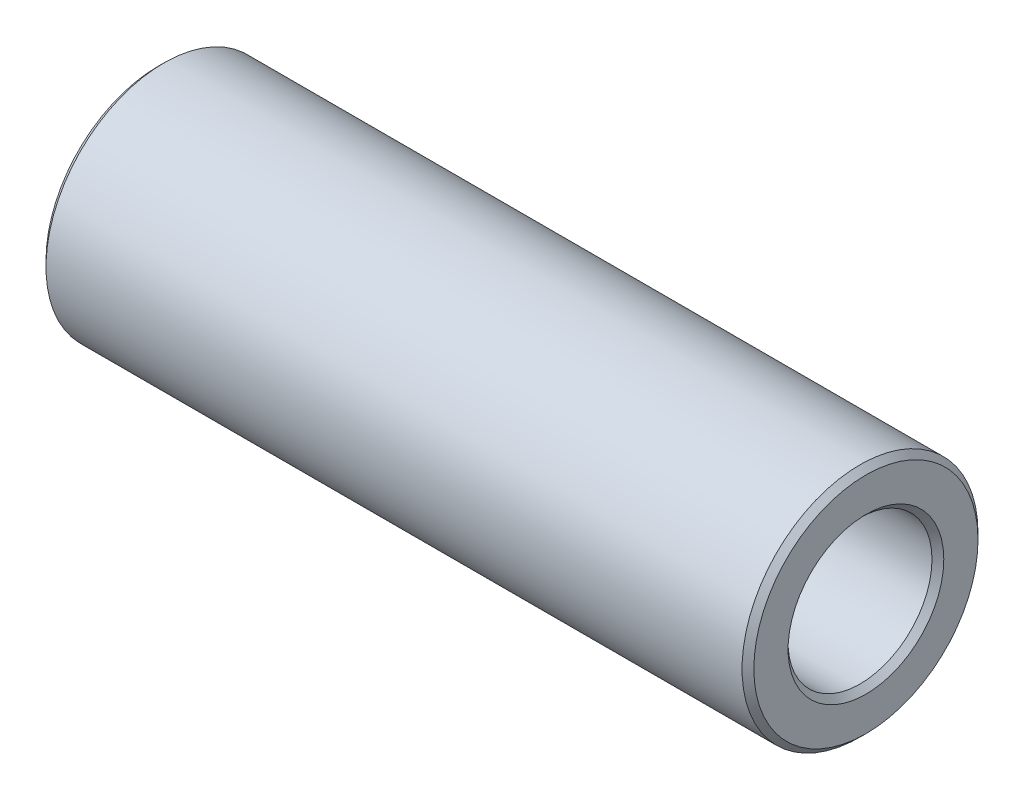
from build123d import *

# Parameters (mm, degrees)
SKETCH_1_R      = 5
SKETCH_1_R_2    = 3.05
EXTRUDE_1_DEPTH = 30
CHAMFER_1_SIZE  = 0.25


with BuildPart() as part:
    # Sketch 1 → Extrude 1 (new body)
    with BuildSketch(Plane(origin=(0, 0, 0), x_dir=(0, 0, -1), z_dir=(1, 0, 0))):
        Circle(SKETCH_1_R)
        Circle(SKETCH_1_R_2, mode=Mode.SUBTRACT)
    extrude(amount=EXTRUDE_1_DEPTH)

    # Chamfer 1
    chamfer_1_edges = [part.edges().sort_by_distance(p)[0] for p in [
        (0, 0, 5),
        (30, 0, 5),
        (0, 0, 3.05),
        (30, 0, 3.05),
    ]]
    chamfer(chamfer_1_edges, length=CHAMFER_1_SIZE)


solid = part.part
